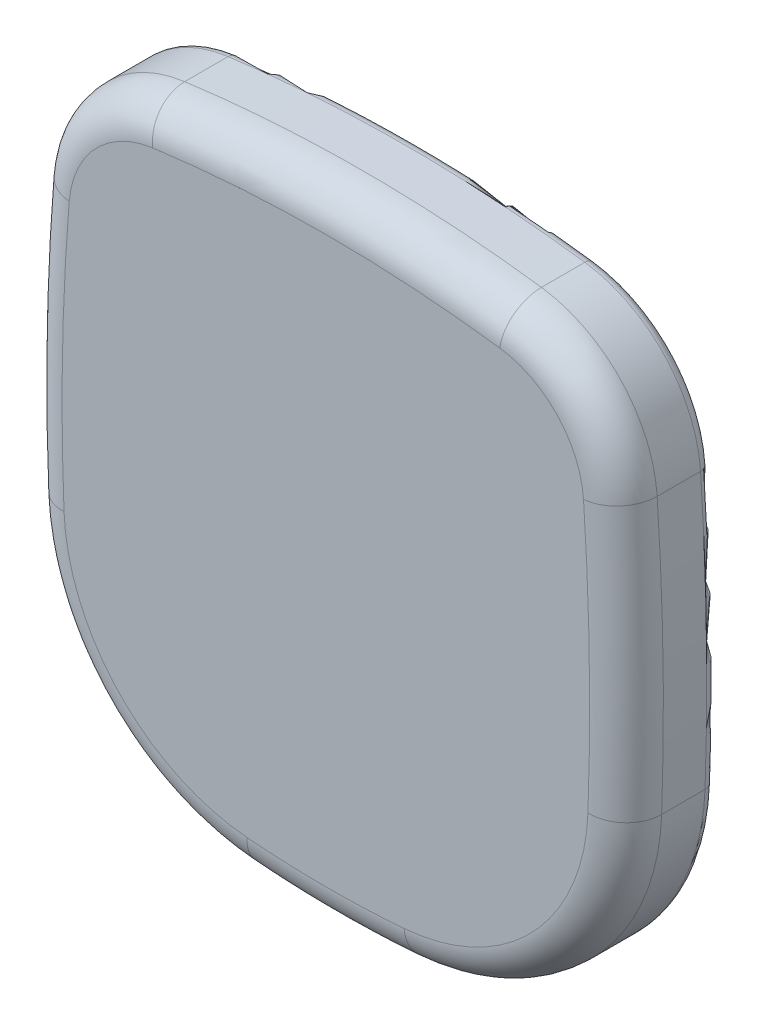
ISO-10303-21;
HEADER;
FILE_DESCRIPTION(('STEP AP214'),'2;1');
FILE_NAME('part.step','',(''),(''),'','','');
FILE_SCHEMA(('AUTOMOTIVE_DESIGN { 1 0 10303 214 1 1 1 1 }'));
ENDSEC;
DATA;
#1=APPLICATION_CONTEXT('core data for automotive mechanical design processes');
#2=APPLICATION_PROTOCOL_DEFINITION('international standard','automotive_design',2000,#1);
#3=PRODUCT_CONTEXT('',#1,'mechanical');
#4=PRODUCT('Part','Part','',(#3));
#5=PRODUCT_RELATED_PRODUCT_CATEGORY('part','',(#4));
#6=PRODUCT_DEFINITION_FORMATION('','',#4);
#7=PRODUCT_DEFINITION_CONTEXT('part definition',#1,'design');
#8=PRODUCT_DEFINITION('design','',#6,#7);
#9=PRODUCT_DEFINITION_SHAPE('','',#8);
#10=(LENGTH_UNIT() NAMED_UNIT(*) SI_UNIT(.MILLI.,.METRE.));
#11=(NAMED_UNIT(*) PLANE_ANGLE_UNIT() SI_UNIT($,.RADIAN.));
#12=(NAMED_UNIT(*) SI_UNIT($,.STERADIAN.) SOLID_ANGLE_UNIT());
#13=UNCERTAINTY_MEASURE_WITH_UNIT(LENGTH_MEASURE(1.E-05),#10,'distance_accuracy_value','');
#14=(GEOMETRIC_REPRESENTATION_CONTEXT(3) GLOBAL_UNCERTAINTY_ASSIGNED_CONTEXT((#13)) GLOBAL_UNIT_ASSIGNED_CONTEXT((#10,
#11,#12)) REPRESENTATION_CONTEXT('',''));
#15=CARTESIAN_POINT('',(0.,0.,0.));
#16=DIRECTION('',(0.,0.,1.));
#17=DIRECTION('',(1.,0.,0.));
#18=AXIS2_PLACEMENT_3D('',#15,#16,#17);
#19=CARTESIAN_POINT('',(-2.00727706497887,710.608425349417,-75.6928010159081));
#20=DIRECTION('',(0.,0.,1.));
#21=DIRECTION('',(0.,-1.,0.));
#22=AXIS2_PLACEMENT_3D('',#19,#20,#21);
#23=PLANE('',#22);
#24=CARTESIAN_POINT('',(-2.00000000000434,-122.046258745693,-75.692801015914));
#25=DIRECTION('',(0.,0.,-1.));
#26=DIRECTION('',(-0.000636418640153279,0.999999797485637,0.));
#27=AXIS2_PLACEMENT_3D('',#24,#25,#26);
#28=CIRCLE('',#27,1098.24229719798);
#29=CARTESIAN_POINT('',(-147.898706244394,966.461761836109,-75.6928010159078));
#30=VERTEX_POINT('',#29);
#31=CARTESIAN_POINT('',(142.513094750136,966.646585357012,-75.6928010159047));
#32=VERTEX_POINT('',#31);
#33=EDGE_CURVE('E37',#30,#32,#28,.T.);
#34=ORIENTED_EDGE('',*,*,#33,.F.);
#35=CARTESIAN_POINT('',(-137.14729439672,886.248589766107,-75.6928010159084));
#36=DIRECTION('',(0.,0.,-1.));
#37=DIRECTION('',(-0.725293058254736,0.688440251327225,0.));
#38=AXIS2_PLACEMENT_3D('',#35,#36,#37);
#39=CIRCLE('',#38,80.9305);
#40=CARTESIAN_POINT('',(-217.811675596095,892.806290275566,-75.6928010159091));
#41=VERTEX_POINT('',#40);
#42=EDGE_CURVE('E265',#41,#30,#39,.T.);
#43=ORIENTED_EDGE('',*,*,#42,.F.);
#44=CARTESIAN_POINT('',(1609.03192702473,744.291009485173,-75.6928010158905));
#45=DIRECTION('',(0.,0.,-1.));
#46=DIRECTION('',(-0.99981732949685,0.0191130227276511,0.));
#47=AXIS2_PLACEMENT_3D('',#44,#45,#46);
#48=CIRCLE('',#47,1832.87051835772);
#49=CARTESIAN_POINT('',(-222.153070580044,665.704486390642,-75.6928010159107));
#50=VERTEX_POINT('',#49);
#51=EDGE_CURVE('E257',#50,#41,#48,.T.);
#52=ORIENTED_EDGE('',*,*,#51,.F.);
#53=CARTESIAN_POINT('',(-55.0024249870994,672.877867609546,-75.6928010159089));
#54=DIRECTION('',(0.,0.,-1.));
#55=DIRECTION('',(-0.721021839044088,-0.69291233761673,0.));
#56=AXIS2_PLACEMENT_3D('',#53,#54,#55);
#57=CIRCLE('',#56,167.3045);
#58=CARTESIAN_POINT('',(-68.8135380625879,506.144401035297,-75.6928010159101));
#59=VERTEX_POINT('',#58);
#60=EDGE_CURVE('E287',#59,#50,#57,.T.);
#61=ORIENTED_EDGE('',*,*,#60,.F.);
#62=CARTESIAN_POINT('',(-2.00000000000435,1312.74505330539,-75.6928010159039));
#63=DIRECTION('',(0.,0.,-1.));
#64=DIRECTION('',(-0.00147322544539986,-0.999998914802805,0.));
#65=AXIS2_PLACEMENT_3D('',#62,#63,#64);
#66=CIRCLE('',#65,809.363120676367);
#67=CARTESIAN_POINT('',(-30.5000000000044,503.8838716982,-75.6928010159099));
#68=VERTEX_POINT('',#67);
#69=EDGE_CURVE('E302',#68,#59,#66,.T.);
#70=ORIENTED_EDGE('',*,*,#69,.F.);
#71=CARTESIAN_POINT('',(-2.00000000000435,1312.74505330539,-75.6928010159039));
#72=DIRECTION('',(0.,0.,-1.));
#73=DIRECTION('',(-0.00147322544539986,-0.999998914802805,0.));
#74=AXIS2_PLACEMENT_3D('',#71,#72,#73);
#75=CIRCLE('',#74,809.363120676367);
#76=CARTESIAN_POINT('',(26.4999999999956,503.8838716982,-75.6928010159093));
#77=VERTEX_POINT('',#76);
#78=EDGE_CURVE('E316',#77,#68,#75,.T.);
#79=ORIENTED_EDGE('',*,*,#78,.F.);
#80=CARTESIAN_POINT('',(-2.00000000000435,1312.74505330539,-75.6928010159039));
#81=DIRECTION('',(0.,0.,-1.));
#82=DIRECTION('',(-0.00147322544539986,-0.999998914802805,0.));
#83=AXIS2_PLACEMENT_3D('',#80,#81,#82);
#84=CIRCLE('',#83,809.363120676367);
#85=CARTESIAN_POINT('',(62.4366414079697,505.951039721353,-75.6928010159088));
#86=VERTEX_POINT('',#85);
#87=EDGE_CURVE('E299',#86,#77,#84,.T.);
#88=ORIENTED_EDGE('',*,*,#87,.F.);
#89=CARTESIAN_POINT('',(49.1168597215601,672.724476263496,-75.6928010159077));
#90=DIRECTION('',(0.,0.,-1.));
#91=DIRECTION('',(0.722234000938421,-0.691648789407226,0.));
#92=AXIS2_PLACEMENT_3D('',#89,#90,#91);
#93=CIRCLE('',#92,167.3045);
#94=CARTESIAN_POINT('',(216.310286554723,666.629089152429,-75.692801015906));
#95=VERTEX_POINT('',#94);
#96=EDGE_CURVE('E168',#95,#86,#93,.T.);
#97=ORIENTED_EDGE('',*,*,#96,.F.);
#98=CARTESIAN_POINT('',(-1913.9174345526,744.291009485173,-75.6928010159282));
#99=DIRECTION('',(0.,0.,-1.));
#100=DIRECTION('',(0.999864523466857,0.016460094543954,0.));
#101=AXIS2_PLACEMENT_3D('',#98,#99,#100);
#102=CIRCLE('',#101,2131.64291513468);
#103=CARTESIAN_POINT('',(212.599682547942,892.028845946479,-75.6928010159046));
#104=VERTEX_POINT('',#103);
#105=EDGE_CURVE('E164',#104,#95,#102,.T.);
#106=ORIENTED_EDGE('',*,*,#105,.F.);
#107=CARTESIAN_POINT('',(131.863789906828,886.419793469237,-75.6928010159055));
#108=DIRECTION('',(0.,0.,-1.));
#109=DIRECTION('',(0.728891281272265,0.684629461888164,0.));
#110=AXIS2_PLACEMENT_3D('',#107,#108,#109);
#111=CIRCLE('',#110,80.9305);
#112=EDGE_CURVE('E28',#32,#104,#111,.T.);
#113=ORIENTED_EDGE('',*,*,#112,.F.);
#114=EDGE_LOOP('',(#34,#43,#52,#61,#70,#79,#88,#97,#106,#113));
#115=FACE_BOUND('',#114,.T.);
#116=ADVANCED_FACE('F17',(#115),#23,.T.);
#117=CARTESIAN_POINT('',(131.863789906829,886.419793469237,-106.548801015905));
#118=DIRECTION('',(0.,0.,-1.));
#119=DIRECTION('',(0.,1.,0.));
#120=AXIS2_PLACEMENT_3D('',#117,#118,#119);
#121=TOROIDAL_SURFACE('',#120,80.9305,30.856);
#122=CARTESIAN_POINT('',(212.599682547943,892.02884594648,-106.548801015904));
#123=DIRECTION('',(0.0693070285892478,-0.997595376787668,0.));
#124=DIRECTION('',(0.997595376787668,0.0693070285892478,0.));
#125=AXIS2_PLACEMENT_3D('',#122,#123,#124);
#126=CIRCLE('',#125,30.8560000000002);
#127=CARTESIAN_POINT('',(243.381485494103,894.167383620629,-106.548801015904));
#128=VERTEX_POINT('',#127);
#129=EDGE_CURVE('E174',#128,#104,#126,.T.);
#130=ORIENTED_EDGE('',*,*,#129,.F.);
#131=CARTESIAN_POINT('',(131.863789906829,886.419793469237,-106.548801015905));
#132=DIRECTION('',(0.,0.,1.));
#133=DIRECTION('',(0.728891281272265,0.684629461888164,0.));
#134=AXIS2_PLACEMENT_3D('',#131,#132,#133);
#135=CIRCLE('',#134,111.7865);
#136=CARTESIAN_POINT('',(146.573306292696,997.234285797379,-106.548801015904));
#137=VERTEX_POINT('',#136);
#138=EDGE_CURVE('E11',#128,#137,#135,.T.);
#139=ORIENTED_EDGE('',*,*,#138,.T.);
#140=CARTESIAN_POINT('',(142.513094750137,966.646585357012,-106.548801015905));
#141=DIRECTION('',(-0.991304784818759,0.13158580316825,0.));
#142=DIRECTION('',(0.,0.,1.));
#143=AXIS2_PLACEMENT_3D('',#140,#141,#142);
#144=CIRCLE('',#143,30.856);
#145=EDGE_CURVE('E181',#32,#137,#144,.T.);
#146=ORIENTED_EDGE('',*,*,#145,.F.);
#147=ORIENTED_EDGE('',*,*,#112,.T.);
#148=EDGE_LOOP('',(#130,#139,#146,#147));
#149=FACE_BOUND('',#148,.T.);
#150=ADVANCED_FACE('F19',(#149),#121,.T.);
#151=CARTESIAN_POINT('',(-1913.9174345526,744.291009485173,-106.548801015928));
#152=DIRECTION('',(0.,0.,-1.));
#153=DIRECTION('',(0.,1.,0.));
#154=AXIS2_PLACEMENT_3D('',#151,#152,#153);
#155=TOROIDAL_SURFACE('',#154,2131.64291513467,30.856);
#156=ORIENTED_EDGE('',*,*,#129,.T.);
#157=ORIENTED_EDGE('',*,*,#105,.T.);
#158=CARTESIAN_POINT('',(216.310286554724,666.629089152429,-106.548801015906));
#159=DIRECTION('',(-0.0364328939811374,-0.999336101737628,0.));
#160=DIRECTION('',(0.999336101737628,-0.0364328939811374,0.));
#161=AXIS2_PLACEMENT_3D('',#158,#159,#160);
#162=CIRCLE('',#161,30.8560000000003);
#163=CARTESIAN_POINT('',(247.14580130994,665.504915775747,-106.548801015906));
#164=VERTEX_POINT('',#163);
#165=EDGE_CURVE('E401',#164,#95,#162,.T.);
#166=ORIENTED_EDGE('',*,*,#165,.F.);
#167=CARTESIAN_POINT('',(-1913.9174345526,744.291009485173,-106.548801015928));
#168=DIRECTION('',(0.,0.,1.));
#169=DIRECTION('',(0.999864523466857,0.016460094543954,0.));
#170=AXIS2_PLACEMENT_3D('',#167,#168,#169);
#171=CIRCLE('',#170,2162.49891513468);
#172=EDGE_CURVE('E175',#164,#128,#171,.T.);
#173=ORIENTED_EDGE('',*,*,#172,.T.);
#174=EDGE_LOOP('',(#156,#157,#166,#173));
#175=FACE_BOUND('',#174,.T.);
#176=ADVANCED_FACE('F184',(#175),#155,.T.);
#177=CARTESIAN_POINT('',(49.1168597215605,672.724476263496,-106.548801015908));
#178=DIRECTION('',(0.,0.,-1.));
#179=DIRECTION('',(0.,1.,0.));
#180=AXIS2_PLACEMENT_3D('',#177,#178,#179);
#181=TOROIDAL_SURFACE('',#180,167.3045,30.856);
#182=ORIENTED_EDGE('',*,*,#165,.T.);
#183=ORIENTED_EDGE('',*,*,#96,.T.);
#184=CARTESIAN_POINT('',(62.4366414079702,505.951039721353,-106.548801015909));
#185=DIRECTION('',(-0.99682576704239,-0.079614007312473,0.));
#186=DIRECTION('',(0.079614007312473,-0.99682576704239,0.));
#187=AXIS2_PLACEMENT_3D('',#184,#185,#186);
#188=CIRCLE('',#187,30.8560000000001);
#189=CARTESIAN_POINT('',(64.8932112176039,475.192983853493,-106.548801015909));
#190=VERTEX_POINT('',#189);
#191=EDGE_CURVE('E295',#190,#86,#188,.T.);
#192=ORIENTED_EDGE('',*,*,#191,.F.);
#193=CARTESIAN_POINT('',(49.1168597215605,672.724476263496,-106.548801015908));
#194=DIRECTION('',(0.,0.,1.));
#195=DIRECTION('',(0.722234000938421,-0.691648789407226,0.));
#196=AXIS2_PLACEMENT_3D('',#193,#194,#195);
#197=CIRCLE('',#196,198.1605);
#198=EDGE_CURVE('E193',#190,#164,#197,.T.);
#199=ORIENTED_EDGE('',*,*,#198,.T.);
#200=EDGE_LOOP('',(#182,#183,#192,#199));
#201=FACE_BOUND('',#200,.T.);
#202=ADVANCED_FACE('F504',(#201),#181,.T.);
#203=CARTESIAN_POINT('',(-2.00000000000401,1312.74505330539,-106.548801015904));
#204=DIRECTION('',(0.,0.,-1.));
#205=DIRECTION('',(0.,1.,0.));
#206=AXIS2_PLACEMENT_3D('',#203,#204,#205);
#207=TOROIDAL_SURFACE('',#206,809.363120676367,30.856);
#208=CARTESIAN_POINT('',(-2.00000000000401,1312.74505330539,-106.548801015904));
#209=DIRECTION('',(0.,0.,1.));
#210=DIRECTION('',(-0.00147322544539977,-0.999998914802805,0.));
#211=AXIS2_PLACEMENT_3D('',#208,#209,#210);
#212=CIRCLE('',#211,840.219120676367);
#213=CARTESIAN_POINT('',(26.499999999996,473.009427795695,-106.548801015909));
#214=VERTEX_POINT('',#213);
#215=EDGE_CURVE('E195',#214,#190,#212,.T.);
#216=ORIENTED_EDGE('',*,*,#215,.T.);
#217=ORIENTED_EDGE('',*,*,#191,.T.);
#218=ORIENTED_EDGE('',*,*,#87,.T.);
#219=ORIENTED_EDGE('',*,*,#78,.T.);
#220=ORIENTED_EDGE('',*,*,#69,.T.);
#221=CARTESIAN_POINT('',(-68.8135380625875,506.144401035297,-106.54880101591));
#222=DIRECTION('',(-0.99658686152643,0.0825507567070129,0.));
#223=DIRECTION('',(-0.0825507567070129,-0.99658686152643,0.));
#224=AXIS2_PLACEMENT_3D('',#221,#222,#223);
#225=CIRCLE('',#224,30.8560000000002);
#226=CARTESIAN_POINT('',(-71.3607242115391,475.393716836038,-106.54880101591));
#227=VERTEX_POINT('',#226);
#228=EDGE_CURVE('E201',#227,#59,#225,.T.);
#229=ORIENTED_EDGE('',*,*,#228,.F.);
#230=CARTESIAN_POINT('',(-2.00000000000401,1312.74505330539,-106.548801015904));
#231=DIRECTION('',(0.,0.,1.));
#232=DIRECTION('',(-0.00147322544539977,-0.999998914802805,0.));
#233=AXIS2_PLACEMENT_3D('',#230,#231,#232);
#234=CIRCLE('',#233,840.219120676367);
#235=CARTESIAN_POINT('',(-30.5000000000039,473.009427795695,-106.54880101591));
#236=VERTEX_POINT('',#235);
#237=EDGE_CURVE('E200',#227,#236,#234,.T.);
#238=ORIENTED_EDGE('',*,*,#237,.T.);
#239=CARTESIAN_POINT('',(-2.00000000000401,1312.74505330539,-106.548801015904));
#240=DIRECTION('',(0.,0.,1.));
#241=DIRECTION('',(-0.00147322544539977,-0.999998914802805,0.));
#242=AXIS2_PLACEMENT_3D('',#239,#240,#241);
#243=CIRCLE('',#242,840.219120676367);
#244=EDGE_CURVE('E196',#236,#214,#243,.T.);
#245=ORIENTED_EDGE('',*,*,#244,.T.);
#246=EDGE_LOOP('',(#216,#217,#218,#219,#220,#229,#238,#245));
#247=FACE_BOUND('',#246,.T.);
#248=ADVANCED_FACE('F472',(#247),#207,.T.);
#249=CARTESIAN_POINT('',(-55.002424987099,672.877867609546,-106.548801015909));
#250=DIRECTION('',(0.,0.,-1.));
#251=DIRECTION('',(0.,1.,0.));
#252=AXIS2_PLACEMENT_3D('',#249,#250,#251);
#253=TOROIDAL_SURFACE('',#252,167.3045,30.856);
#254=ORIENTED_EDGE('',*,*,#228,.T.);
#255=ORIENTED_EDGE('',*,*,#60,.T.);
#256=CARTESIAN_POINT('',(-222.153070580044,665.704486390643,-106.548801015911));
#257=DIRECTION('',(-0.0428762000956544,0.999080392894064,0.));
#258=DIRECTION('',(-0.999080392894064,-0.0428762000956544,0.));
#259=AXIS2_PLACEMENT_3D('',#256,#257,#258);
#260=CIRCLE('',#259,30.8560000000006);
#261=CARTESIAN_POINT('',(-252.980695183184,664.381498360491,-106.548801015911));
#262=VERTEX_POINT('',#261);
#263=EDGE_CURVE('E408',#262,#50,#260,.T.);
#264=ORIENTED_EDGE('',*,*,#263,.F.);
#265=CARTESIAN_POINT('',(-55.002424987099,672.877867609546,-106.548801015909));
#266=DIRECTION('',(0.,0.,1.));
#267=DIRECTION('',(-0.721021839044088,-0.69291233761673,0.));
#268=AXIS2_PLACEMENT_3D('',#265,#266,#267);
#269=CIRCLE('',#268,198.1605);
#270=EDGE_CURVE('E411',#262,#227,#269,.T.);
#271=ORIENTED_EDGE('',*,*,#270,.T.);
#272=EDGE_LOOP('',(#254,#255,#264,#271));
#273=FACE_BOUND('',#272,.T.);
#274=ADVANCED_FACE('F476',(#273),#253,.T.);
#275=CARTESIAN_POINT('',(1609.03192702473,744.291009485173,-106.548801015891));
#276=DIRECTION('',(0.,0.,-1.));
#277=DIRECTION('',(0.,1.,0.));
#278=AXIS2_PLACEMENT_3D('',#275,#276,#277);
#279=TOROIDAL_SURFACE('',#278,1832.87051835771,30.856);
#280=ORIENTED_EDGE('',*,*,#263,.T.);
#281=ORIENTED_EDGE('',*,*,#51,.T.);
#282=CARTESIAN_POINT('',(-217.811675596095,892.806290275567,-106.548801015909));
#283=DIRECTION('',(0.0810287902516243,0.996711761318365,0.));
#284=DIRECTION('',(-0.996711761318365,0.0810287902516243,0.));
#285=AXIS2_PLACEMENT_3D('',#282,#283,#284);
#286=CIRCLE('',#285,30.8559999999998);
#287=CARTESIAN_POINT('',(-248.566213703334,895.306514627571,-106.548801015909));
#288=VERTEX_POINT('',#287);
#289=EDGE_CURVE('E258',#288,#41,#286,.T.);
#290=ORIENTED_EDGE('',*,*,#289,.F.);
#291=CARTESIAN_POINT('',(1609.03192702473,744.291009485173,-106.548801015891));
#292=DIRECTION('',(0.,0.,1.));
#293=DIRECTION('',(-0.99981732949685,0.0191130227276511,0.));
#294=AXIS2_PLACEMENT_3D('',#291,#292,#293);
#295=CIRCLE('',#294,1863.72651835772);
#296=EDGE_CURVE('E254',#288,#262,#295,.T.);
#297=ORIENTED_EDGE('',*,*,#296,.T.);
#298=EDGE_LOOP('',(#280,#281,#290,#297));
#299=FACE_BOUND('',#298,.T.);
#300=ADVANCED_FACE('F478',(#299),#279,.T.);
#301=CARTESIAN_POINT('',(-137.147294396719,886.248589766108,-106.548801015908));
#302=DIRECTION('',(0.,0.,-1.));
#303=DIRECTION('',(0.,1.,0.));
#304=AXIS2_PLACEMENT_3D('',#301,#302,#303);
#305=TOROIDAL_SURFACE('',#304,80.9305,30.856);
#306=ORIENTED_EDGE('',*,*,#289,.T.);
#307=ORIENTED_EDGE('',*,*,#42,.T.);
#308=CARTESIAN_POINT('',(-147.898706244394,966.461761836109,-106.548801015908));
#309=DIRECTION('',(0.991136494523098,0.132847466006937,0.));
#310=DIRECTION('',(-0.132847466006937,0.991136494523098,0.));
#311=AXIS2_PLACEMENT_3D('',#308,#309,#310);
#312=CIRCLE('',#311,30.8560000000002);
#313=CARTESIAN_POINT('',(-151.997847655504,997.044269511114,-106.548801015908));
#314=VERTEX_POINT('',#313);
#315=EDGE_CURVE('E204',#314,#30,#312,.T.);
#316=ORIENTED_EDGE('',*,*,#315,.F.);
#317=CARTESIAN_POINT('',(-137.147294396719,886.248589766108,-106.548801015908));
#318=DIRECTION('',(0.,0.,1.));
#319=DIRECTION('',(-0.725293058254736,0.688440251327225,0.));
#320=AXIS2_PLACEMENT_3D('',#317,#318,#319);
#321=CIRCLE('',#320,111.7865);
#322=EDGE_CURVE('E326',#314,#288,#321,.T.);
#323=ORIENTED_EDGE('',*,*,#322,.T.);
#324=EDGE_LOOP('',(#306,#307,#316,#323));
#325=FACE_BOUND('',#324,.T.);
#326=ADVANCED_FACE('F532',(#325),#305,.T.);
#327=CARTESIAN_POINT('',(-2.00000000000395,-122.046258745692,-106.548801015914));
#328=DIRECTION('',(0.,0.,-1.));
#329=DIRECTION('',(0.,1.,0.));
#330=AXIS2_PLACEMENT_3D('',#327,#328,#329);
#331=TOROIDAL_SURFACE('',#330,1098.24229719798,30.856);
#332=ORIENTED_EDGE('',*,*,#315,.T.);
#333=ORIENTED_EDGE('',*,*,#33,.T.);
#334=ORIENTED_EDGE('',*,*,#145,.T.);
#335=CARTESIAN_POINT('',(-2.00000000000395,-122.046258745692,-106.548801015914));
#336=DIRECTION('',(0.,0.,1.));
#337=DIRECTION('',(-0.000636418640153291,0.999999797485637,0.));
#338=AXIS2_PLACEMENT_3D('',#335,#336,#337);
#339=CIRCLE('',#338,1129.09829719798);
#340=EDGE_CURVE('E261',#137,#314,#339,.T.);
#341=ORIENTED_EDGE('',*,*,#340,.T.);
#342=EDGE_LOOP('',(#332,#333,#334,#341));
#343=FACE_BOUND('',#342,.T.);
#344=ADVANCED_FACE('F530',(#343),#331,.T.);
#345=CARTESIAN_POINT('',(-2.00000000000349,639.791009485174,-151.692801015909));
#346=DIRECTION('',(0.,0.,1.));
#347=DIRECTION('',(0.,-1.,0.));
#348=AXIS2_PLACEMENT_3D('',#345,#346,#347);
#349=PLANE('',#348);
#350=CARTESIAN_POINT('',(-2.00000000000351,1312.74505330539,-151.692801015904));
#351=DIRECTION('',(0.,0.,1.));
#352=DIRECTION('',(0.,-1.,0.));
#353=AXIS2_PLACEMENT_3D('',#350,#351,#352);
#354=CIRCLE('',#353,831.393620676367);
#355=CARTESIAN_POINT('',(-40.0000000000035,482.220308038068,-151.69280101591));
#356=VERTEX_POINT('',#355);
#357=CARTESIAN_POINT('',(39.9999999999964,482.412979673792,-151.692801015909));
#358=VERTEX_POINT('',#357);
#359=EDGE_CURVE('E283',#356,#358,#354,.T.);
#360=ORIENTED_EDGE('',*,*,#359,.F.);
#361=CARTESIAN_POINT('',(-2.00000000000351,1312.74505330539,-151.692801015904));
#362=DIRECTION('',(0.,0.,1.));
#363=DIRECTION('',(-0.00147322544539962,-0.999998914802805,0.));
#364=AXIS2_PLACEMENT_3D('',#361,#362,#363);
#365=CIRCLE('',#364,831.393620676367);
#366=CARTESIAN_POINT('',(-70.6321725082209,484.18909418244,-151.69280101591));
#367=VERTEX_POINT('',#366);
#368=EDGE_CURVE('E322',#367,#356,#365,.T.);
#369=ORIENTED_EDGE('',*,*,#368,.F.);
#370=CARTESIAN_POINT('',(-55.0024249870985,672.877867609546,-151.692801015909));
#371=DIRECTION('',(0.,0.,1.));
#372=DIRECTION('',(-0.721021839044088,-0.69291233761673,0.));
#373=AXIS2_PLACEMENT_3D('',#370,#371,#372);
#374=CIRCLE('',#373,189.335);
#375=CARTESIAN_POINT('',(-244.163311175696,664.759902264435,-151.692801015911));
#376=VERTEX_POINT('',#375);
#377=EDGE_CURVE('E290',#376,#367,#374,.T.);
#378=ORIENTED_EDGE('',*,*,#377,.F.);
#379=CARTESIAN_POINT('',(1609.03192702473,744.291009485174,-151.692801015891));
#380=DIRECTION('',(0.,0.,1.));
#381=DIRECTION('',(-0.99981732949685,0.019113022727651,0.));
#382=AXIS2_PLACEMENT_3D('',#379,#380,#381);
#383=CIRCLE('',#382,1854.90101835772);
#384=CARTESIAN_POINT('',(-245.447805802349,704.759902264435,-151.692801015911));
#385=VERTEX_POINT('',#384);
#386=EDGE_CURVE('E248',#385,#376,#383,.T.);
#387=ORIENTED_EDGE('',*,*,#386,.F.);
#388=CARTESIAN_POINT('',(1609.03192702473,744.291009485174,-151.692801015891));
#389=DIRECTION('',(0.,0.,1.));
#390=DIRECTION('',(-0.99981732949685,0.019113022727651,0.));
#391=AXIS2_PLACEMENT_3D('',#388,#389,#390);
#392=CIRCLE('',#391,1854.90101835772);
#393=CARTESIAN_POINT('',(-245.756150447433,764.759902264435,-151.69280101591));
#394=VERTEX_POINT('',#393);
#395=EDGE_CURVE('E209',#394,#385,#392,.T.);
#396=ORIENTED_EDGE('',*,*,#395,.F.);
#397=CARTESIAN_POINT('',(1609.03192702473,744.291009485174,-151.692801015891));
#398=DIRECTION('',(0.,0.,1.));
#399=DIRECTION('',(-0.99981732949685,0.019113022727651,0.));
#400=AXIS2_PLACEMENT_3D('',#397,#398,#399);
#401=CIRCLE('',#400,1854.90101835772);
#402=CARTESIAN_POINT('',(-239.769734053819,894.591395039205,-151.692801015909));
#403=VERTEX_POINT('',#402);
#404=EDGE_CURVE('E205',#403,#394,#401,.T.);
#405=ORIENTED_EDGE('',*,*,#404,.F.);
#406=CARTESIAN_POINT('',(-137.147294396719,886.248589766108,-151.692801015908));
#407=DIRECTION('',(0.,0.,1.));
#408=DIRECTION('',(-0.725293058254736,0.688440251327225,0.));
#409=AXIS2_PLACEMENT_3D('',#406,#407,#408);
#410=CIRCLE('',#409,102.961);
#411=CARTESIAN_POINT('',(-150.825402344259,988.296994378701,-151.692801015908));
#412=VERTEX_POINT('',#411);
#413=EDGE_CURVE('E312',#412,#403,#410,.T.);
#414=ORIENTED_EDGE('',*,*,#413,.F.);
#415=CARTESIAN_POINT('',(-2.00000000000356,-122.046258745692,-151.692801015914));
#416=DIRECTION('',(0.,0.,1.));
#417=DIRECTION('',(-0.000636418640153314,0.999999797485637,0.));
#418=AXIS2_PLACEMENT_3D('',#415,#416,#417);
#419=CIRCLE('',#418,1120.27279719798);
#420=CARTESIAN_POINT('',(145.411995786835,988.485525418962,-151.692801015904));
#421=VERTEX_POINT('',#420);
#422=EDGE_CURVE('E343',#421,#412,#419,.T.);
#423=ORIENTED_EDGE('',*,*,#422,.F.);
#424=CARTESIAN_POINT('',(131.863789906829,886.419793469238,-151.692801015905));
#425=DIRECTION('',(0.,0.,1.));
#426=DIRECTION('',(0.728891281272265,0.684629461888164,0.));
#427=AXIS2_PLACEMENT_3D('',#424,#425,#426);
#428=CIRCLE('',#427,102.961);
#429=CARTESIAN_POINT('',(234.577207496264,893.555714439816,-151.692801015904));
#430=VERTEX_POINT('',#429);
#431=EDGE_CURVE('E241',#430,#421,#428,.T.);
#432=ORIENTED_EDGE('',*,*,#431,.F.);
#433=CARTESIAN_POINT('',(-1913.9174345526,744.291009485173,-151.692801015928));
#434=DIRECTION('',(0.,0.,1.));
#435=DIRECTION('',(0.999864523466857,0.016460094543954,0.));
#436=AXIS2_PLACEMENT_3D('',#433,#434,#435);
#437=CIRCLE('',#436,2153.67341513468);
#438=CARTESIAN_POINT('',(239.658708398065,764.759902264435,-151.692801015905));
#439=VERTEX_POINT('',#438);
#440=EDGE_CURVE('E249',#439,#430,#437,.T.);
#441=ORIENTED_EDGE('',*,*,#440,.F.);
#442=CARTESIAN_POINT('',(-1913.9174345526,744.291009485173,-151.692801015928));
#443=DIRECTION('',(0.,0.,1.));
#444=DIRECTION('',(0.999864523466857,0.016460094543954,0.));
#445=AXIS2_PLACEMENT_3D('',#442,#443,#444);
#446=CIRCLE('',#445,2153.67341513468);
#447=CARTESIAN_POINT('',(239.393149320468,704.759902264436,-151.692801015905));
#448=VERTEX_POINT('',#447);
#449=EDGE_CURVE('E252',#448,#439,#446,.T.);
#450=ORIENTED_EDGE('',*,*,#449,.F.);
#451=CARTESIAN_POINT('',(-1913.9174345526,744.291009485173,-151.692801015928));
#452=DIRECTION('',(0.,0.,1.));
#453=DIRECTION('',(0.999864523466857,0.016460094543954,0.));
#454=AXIS2_PLACEMENT_3D('',#451,#452,#453);
#455=CIRCLE('',#454,2153.67341513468);
#456=CARTESIAN_POINT('',(238.326160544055,665.826454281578,-151.692801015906));
#457=VERTEX_POINT('',#456);
#458=EDGE_CURVE('E279',#457,#448,#455,.T.);
#459=ORIENTED_EDGE('',*,*,#458,.F.);
#460=CARTESIAN_POINT('',(49.116859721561,672.724476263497,-151.692801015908));
#461=DIRECTION('',(0.,0.,1.));
#462=DIRECTION('',(0.72223400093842,-0.691648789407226,0.));
#463=AXIS2_PLACEMENT_3D('',#460,#461,#462);
#464=CIRCLE('',#463,189.335);
#465=CARTESIAN_POINT('',(64.190577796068,483.990469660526,-151.692801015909));
#466=VERTEX_POINT('',#465);
#467=EDGE_CURVE('E356',#466,#457,#464,.T.);
#468=ORIENTED_EDGE('',*,*,#467,.F.);
#469=CARTESIAN_POINT('',(-2.00000000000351,1312.74505330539,-151.692801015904));
#470=DIRECTION('',(0.,0.,1.));
#471=DIRECTION('',(-0.00147322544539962,-0.999998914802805,0.));
#472=AXIS2_PLACEMENT_3D('',#469,#470,#471);
#473=CIRCLE('',#472,831.393620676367);
#474=EDGE_CURVE('E280',#358,#466,#473,.T.);
#475=ORIENTED_EDGE('',*,*,#474,.F.);
#476=EDGE_LOOP('',(#360,#369,#378,#387,#396,#405,#414,#423,#432,#441,#450,#459,#468,#475));
#477=FACE_BOUND('',#476,.T.);
#478=ADVANCED_FACE('F435',(#477),#349,.F.);
#479=CARTESIAN_POINT('',(-2.00000000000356,-122.046258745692,-142.867301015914));
#480=DIRECTION('',(0.,0.,1.));
#481=DIRECTION('',(0.,-1.,0.));
#482=AXIS2_PLACEMENT_3D('',#479,#480,#481);
#483=TOROIDAL_SURFACE('',#482,1120.27279719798,8.8255);
#484=CARTESIAN_POINT('',(145.411995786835,988.485525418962,-142.867301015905));
#485=DIRECTION('',(-0.991304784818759,0.13158580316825,0.));
#486=DIRECTION('',(0.13158580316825,0.991304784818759,0.));
#487=AXIS2_PLACEMENT_3D('',#484,#485,#486);
#488=CIRCLE('',#487,8.82550000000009);
#489=CARTESIAN_POINT('',(146.573306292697,997.23428579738,-142.867301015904));
#490=VERTEX_POINT('',#489);
#491=EDGE_CURVE('E346',#490,#421,#488,.T.);
#492=ORIENTED_EDGE('',*,*,#491,.T.);
#493=ORIENTED_EDGE('',*,*,#422,.T.);
#494=CARTESIAN_POINT('',(-150.825402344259,988.2969943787,-142.867301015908));
#495=DIRECTION('',(0.991136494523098,0.132847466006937,0.));
#496=DIRECTION('',(0.,0.,-1.));
#497=AXIS2_PLACEMENT_3D('',#494,#495,#496);
#498=CIRCLE('',#497,8.82550000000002);
#499=CARTESIAN_POINT('',(-151.997847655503,997.044269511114,-142.867301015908));
#500=VERTEX_POINT('',#499);
#501=EDGE_CURVE('E347',#412,#500,#498,.T.);
#502=ORIENTED_EDGE('',*,*,#501,.T.);
#503=CARTESIAN_POINT('',(-2.00000000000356,-122.046258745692,-142.867301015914));
#504=DIRECTION('',(0.,0.,-1.));
#505=DIRECTION('',(-0.000636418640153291,0.999999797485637,0.));
#506=AXIS2_PLACEMENT_3D('',#503,#504,#505);
#507=CIRCLE('',#506,1129.09829719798);
#508=EDGE_CURVE('E351',#500,#490,#507,.T.);
#509=ORIENTED_EDGE('',*,*,#508,.T.);
#510=EDGE_LOOP('',(#492,#493,#502,#509));
#511=FACE_BOUND('',#510,.T.);
#512=ADVANCED_FACE('F439',(#511),#483,.T.);
#513=CARTESIAN_POINT('',(-137.147294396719,886.248589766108,-142.867301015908));
#514=DIRECTION('',(0.,0.,-1.));
#515=DIRECTION('',(0.,1.,0.));
#516=AXIS2_PLACEMENT_3D('',#513,#514,#515);
#517=TOROIDAL_SURFACE('',#516,102.961,8.8255);
#518=CARTESIAN_POINT('',(-239.769734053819,894.591395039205,-142.867301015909));
#519=DIRECTION('',(0.0810287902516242,0.996711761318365,0.));
#520=DIRECTION('',(0.,0.,-1.));
#521=AXIS2_PLACEMENT_3D('',#518,#519,#520);
#522=CIRCLE('',#521,8.82550000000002);
#523=CARTESIAN_POINT('',(-248.566213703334,895.306514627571,-142.867301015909));
#524=VERTEX_POINT('',#523);
#525=EDGE_CURVE('E311',#403,#524,#522,.T.);
#526=ORIENTED_EDGE('',*,*,#525,.T.);
#527=CARTESIAN_POINT('',(-137.147294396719,886.248589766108,-142.867301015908));
#528=DIRECTION('',(0.,0.,-1.));
#529=DIRECTION('',(-0.725293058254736,0.688440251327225,0.));
#530=AXIS2_PLACEMENT_3D('',#527,#528,#529);
#531=CIRCLE('',#530,111.7865);
#532=EDGE_CURVE('E307',#524,#500,#531,.T.);
#533=ORIENTED_EDGE('',*,*,#532,.T.);
#534=ORIENTED_EDGE('',*,*,#501,.F.);
#535=ORIENTED_EDGE('',*,*,#413,.T.);
#536=EDGE_LOOP('',(#526,#533,#534,#535));
#537=FACE_BOUND('',#536,.T.);
#538=ADVANCED_FACE('F493',(#537),#517,.T.);
#539=CARTESIAN_POINT('',(131.863789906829,886.419793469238,-142.867301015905));
#540=DIRECTION('',(0.,0.,1.));
#541=DIRECTION('',(0.,-1.,0.));
#542=AXIS2_PLACEMENT_3D('',#539,#540,#541);
#543=TOROIDAL_SURFACE('',#542,102.961,8.8255);
#544=CARTESIAN_POINT('',(234.577207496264,893.555714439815,-142.867301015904));
#545=DIRECTION('',(-0.0693070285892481,0.997595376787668,0.));
#546=DIRECTION('',(0.997595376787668,0.0693070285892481,0.));
#547=AXIS2_PLACEMENT_3D('',#544,#545,#546);
#548=CIRCLE('',#547,8.82549999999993);
#549=CARTESIAN_POINT('',(243.381485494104,894.16738362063,-142.867301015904));
#550=VERTEX_POINT('',#549);
#551=EDGE_CURVE('E243',#550,#430,#548,.T.);
#552=ORIENTED_EDGE('',*,*,#551,.T.);
#553=ORIENTED_EDGE('',*,*,#431,.T.);
#554=ORIENTED_EDGE('',*,*,#491,.F.);
#555=CARTESIAN_POINT('',(131.863789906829,886.419793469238,-142.867301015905));
#556=DIRECTION('',(0.,0.,-1.));
#557=DIRECTION('',(0.728891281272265,0.684629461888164,0.));
#558=AXIS2_PLACEMENT_3D('',#555,#556,#557);
#559=CIRCLE('',#558,111.7865);
#560=EDGE_CURVE('E244',#490,#550,#559,.T.);
#561=ORIENTED_EDGE('',*,*,#560,.T.);
#562=EDGE_LOOP('',(#552,#553,#554,#561));
#563=FACE_BOUND('',#562,.T.);
#564=ADVANCED_FACE('F427',(#563),#543,.T.);
#565=CARTESIAN_POINT('',(-1913.9174345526,744.291009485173,-142.867301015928));
#566=DIRECTION('',(0.,0.,1.));
#567=DIRECTION('',(0.,-1.,0.));
#568=AXIS2_PLACEMENT_3D('',#565,#566,#567);
#569=TOROIDAL_SURFACE('',#568,2153.67341513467,8.8255);
#570=CARTESIAN_POINT('',(238.326160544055,665.826454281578,-142.867301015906));
#571=DIRECTION('',(0.0364328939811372,0.999336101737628,0.));
#572=DIRECTION('',(0.999336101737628,-0.0364328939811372,0.));
#573=AXIS2_PLACEMENT_3D('',#570,#571,#572);
#574=CIRCLE('',#573,8.82550000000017);
#575=CARTESIAN_POINT('',(247.145801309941,665.504915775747,-142.867301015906));
#576=VERTEX_POINT('',#575);
#577=EDGE_CURVE('E368',#576,#457,#574,.T.);
#578=ORIENTED_EDGE('',*,*,#577,.T.);
#579=ORIENTED_EDGE('',*,*,#458,.T.);
#580=ORIENTED_EDGE('',*,*,#449,.T.);
#581=ORIENTED_EDGE('',*,*,#440,.T.);
#582=ORIENTED_EDGE('',*,*,#551,.F.);
#583=CARTESIAN_POINT('',(-1913.9174345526,744.291009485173,-142.867301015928));
#584=DIRECTION('',(0.,0.,-1.));
#585=DIRECTION('',(0.999864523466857,0.016460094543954,0.));
#586=AXIS2_PLACEMENT_3D('',#583,#584,#585);
#587=CIRCLE('',#586,2162.49891513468);
#588=EDGE_CURVE('E253',#550,#576,#587,.T.);
#589=ORIENTED_EDGE('',*,*,#588,.T.);
#590=EDGE_LOOP('',(#578,#579,#580,#581,#582,#589));
#591=FACE_BOUND('',#590,.T.);
#592=ADVANCED_FACE('F432',(#591),#569,.T.);
#593=CARTESIAN_POINT('',(1609.03192702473,744.291009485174,-142.867301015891));
#594=DIRECTION('',(0.,0.,-1.));
#595=DIRECTION('',(0.,1.,0.));
#596=AXIS2_PLACEMENT_3D('',#593,#594,#595);
#597=TOROIDAL_SURFACE('',#596,1854.90101835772,8.8255);
#598=CARTESIAN_POINT('',(-244.163311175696,664.759902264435,-142.867301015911));
#599=DIRECTION('',(-0.0428762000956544,0.999080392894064,0.));
#600=DIRECTION('',(0.,0.,-1.));
#601=AXIS2_PLACEMENT_3D('',#598,#599,#600);
#602=CIRCLE('',#601,8.82550000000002);
#603=CARTESIAN_POINT('',(-252.980695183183,664.381498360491,-142.867301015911));
#604=VERTEX_POINT('',#603);
#605=EDGE_CURVE('E303',#376,#604,#602,.T.);
#606=ORIENTED_EDGE('',*,*,#605,.T.);
#607=CARTESIAN_POINT('',(1609.03192702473,744.291009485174,-142.867301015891));
#608=DIRECTION('',(0.,0.,-1.));
#609=DIRECTION('',(-0.99981732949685,0.0191130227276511,0.));
#610=AXIS2_PLACEMENT_3D('',#607,#608,#609);
#611=CIRCLE('',#610,1863.72651835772);
#612=EDGE_CURVE('E208',#604,#524,#611,.T.);
#613=ORIENTED_EDGE('',*,*,#612,.T.);
#614=ORIENTED_EDGE('',*,*,#525,.F.);
#615=ORIENTED_EDGE('',*,*,#404,.T.);
#616=ORIENTED_EDGE('',*,*,#395,.T.);
#617=ORIENTED_EDGE('',*,*,#386,.T.);
#618=EDGE_LOOP('',(#606,#613,#614,#615,#616,#617));
#619=FACE_BOUND('',#618,.T.);
#620=ADVANCED_FACE('F495',(#619),#597,.T.);
#621=CARTESIAN_POINT('',(49.1168597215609,672.724476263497,-142.867301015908));
#622=DIRECTION('',(0.,0.,1.));
#623=DIRECTION('',(0.,-1.,0.));
#624=AXIS2_PLACEMENT_3D('',#621,#622,#623);
#625=TOROIDAL_SURFACE('',#624,189.335,8.8255);
#626=CARTESIAN_POINT('',(64.1905777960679,483.990469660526,-142.867301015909));
#627=DIRECTION('',(0.99682576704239,0.079614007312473,0.));
#628=DIRECTION('',(0.079614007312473,-0.99682576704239,0.));
#629=AXIS2_PLACEMENT_3D('',#626,#627,#628);
#630=CIRCLE('',#629,8.82550000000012);
#631=CARTESIAN_POINT('',(64.8932112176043,475.192983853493,-142.867301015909));
#632=VERTEX_POINT('',#631);
#633=EDGE_CURVE('E358',#632,#466,#630,.T.);
#634=ORIENTED_EDGE('',*,*,#633,.T.);
#635=ORIENTED_EDGE('',*,*,#467,.T.);
#636=ORIENTED_EDGE('',*,*,#577,.F.);
#637=CARTESIAN_POINT('',(49.1168597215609,672.724476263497,-142.867301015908));
#638=DIRECTION('',(0.,0.,-1.));
#639=DIRECTION('',(0.722234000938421,-0.691648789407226,0.));
#640=AXIS2_PLACEMENT_3D('',#637,#638,#639);
#641=CIRCLE('',#640,198.1605);
#642=EDGE_CURVE('E270',#576,#632,#641,.T.);
#643=ORIENTED_EDGE('',*,*,#642,.T.);
#644=EDGE_LOOP('',(#634,#635,#636,#643));
#645=FACE_BOUND('',#644,.T.);
#646=ADVANCED_FACE('F366',(#645),#625,.T.);
#647=CARTESIAN_POINT('',(-55.0024249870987,672.877867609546,-142.867301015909));
#648=DIRECTION('',(0.,0.,-1.));
#649=DIRECTION('',(0.,1.,0.));
#650=AXIS2_PLACEMENT_3D('',#647,#648,#649);
#651=TOROIDAL_SURFACE('',#650,189.335,8.8255);
#652=CARTESIAN_POINT('',(-70.6321725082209,484.18909418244,-142.86730101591));
#653=DIRECTION('',(-0.99658686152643,0.0825507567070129,0.));
#654=DIRECTION('',(0.,0.,-1.));
#655=AXIS2_PLACEMENT_3D('',#652,#653,#654);
#656=CIRCLE('',#655,8.82550000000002);
#657=CARTESIAN_POINT('',(-71.3607242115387,475.393716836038,-142.86730101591));
#658=VERTEX_POINT('',#657);
#659=EDGE_CURVE('E266',#367,#658,#656,.T.);
#660=ORIENTED_EDGE('',*,*,#659,.T.);
#661=CARTESIAN_POINT('',(-55.0024249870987,672.877867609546,-142.867301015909));
#662=DIRECTION('',(0.,0.,-1.));
#663=DIRECTION('',(-0.721021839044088,-0.69291233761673,0.));
#664=AXIS2_PLACEMENT_3D('',#661,#662,#663);
#665=CIRCLE('',#664,198.1605);
#666=EDGE_CURVE('E271',#658,#604,#665,.T.);
#667=ORIENTED_EDGE('',*,*,#666,.T.);
#668=ORIENTED_EDGE('',*,*,#605,.F.);
#669=ORIENTED_EDGE('',*,*,#377,.T.);
#670=EDGE_LOOP('',(#660,#667,#668,#669));
#671=FACE_BOUND('',#670,.T.);
#672=ADVANCED_FACE('F554',(#671),#651,.T.);
#673=CARTESIAN_POINT('',(-2.00000000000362,1312.74505330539,-142.867301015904));
#674=DIRECTION('',(0.,0.,1.));
#675=DIRECTION('',(0.,-1.,0.));
#676=AXIS2_PLACEMENT_3D('',#673,#674,#675);
#677=TOROIDAL_SURFACE('',#676,831.393620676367,8.8255);
#678=CARTESIAN_POINT('',(-2.00000000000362,1312.74505330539,-142.867301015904));
#679=DIRECTION('',(0.,0.,-1.));
#680=DIRECTION('',(-0.00147322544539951,-0.999998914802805,0.));
#681=AXIS2_PLACEMENT_3D('',#678,#679,#680);
#682=CIRCLE('',#681,840.219120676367);
#683=CARTESIAN_POINT('',(26.4999999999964,473.009427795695,-142.867301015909));
#684=VERTEX_POINT('',#683);
#685=CARTESIAN_POINT('',(-30.5000000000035,473.009427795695,-142.86730101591));
#686=VERTEX_POINT('',#685);
#687=EDGE_CURVE('E134',#684,#686,#682,.T.);
#688=ORIENTED_EDGE('',*,*,#687,.T.);
#689=CARTESIAN_POINT('',(-2.00000000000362,1312.74505330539,-142.867301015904));
#690=DIRECTION('',(0.,0.,-1.));
#691=DIRECTION('',(-0.00147322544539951,-0.999998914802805,0.));
#692=AXIS2_PLACEMENT_3D('',#689,#690,#691);
#693=CIRCLE('',#692,840.219120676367);
#694=EDGE_CURVE('E291',#686,#658,#693,.T.);
#695=ORIENTED_EDGE('',*,*,#694,.T.);
#696=ORIENTED_EDGE('',*,*,#659,.F.);
#697=ORIENTED_EDGE('',*,*,#368,.T.);
#698=ORIENTED_EDGE('',*,*,#359,.T.);
#699=ORIENTED_EDGE('',*,*,#474,.T.);
#700=ORIENTED_EDGE('',*,*,#633,.F.);
#701=CARTESIAN_POINT('',(-2.00000000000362,1312.74505330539,-142.867301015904));
#702=DIRECTION('',(0.,0.,-1.));
#703=DIRECTION('',(-0.00147322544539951,-0.999998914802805,0.));
#704=AXIS2_PLACEMENT_3D('',#701,#702,#703);
#705=CIRCLE('',#704,840.219120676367);
#706=EDGE_CURVE('E21',#632,#684,#705,.T.);
#707=ORIENTED_EDGE('',*,*,#706,.T.);
#708=EDGE_LOOP('',(#688,#695,#696,#697,#698,#699,#700,#707));
#709=FACE_BOUND('',#708,.T.);
#710=ADVANCED_FACE('F373',(#709),#677,.T.);
#711=CARTESIAN_POINT('',(49.1168597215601,672.724476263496,-75.6928010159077));
#712=DIRECTION('',(0.,0.,-1.));
#713=DIRECTION('',(0.722234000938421,-0.691648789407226,0.));
#714=AXIS2_PLACEMENT_3D('',#711,#712,#713);
#715=CYLINDRICAL_SURFACE('',#714,198.1605);
#716=ORIENTED_EDGE('',*,*,#642,.F.);
#717=DIRECTION('',(0.,0.,1.));
#718=VECTOR('',#717,1.);
#719=CARTESIAN_POINT('',(247.14580130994,665.504915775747,-75.6928010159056));
#720=LINE('',#719,#718);
#721=EDGE_CURVE('E272',#576,#164,#720,.T.);
#722=ORIENTED_EDGE('',*,*,#721,.T.);
#723=ORIENTED_EDGE('',*,*,#198,.F.);
#724=DIRECTION('',(0.,0.,-1.));
#725=VECTOR('',#724,1.);
#726=CARTESIAN_POINT('',(64.8932112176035,475.192983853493,-75.692801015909));
#727=LINE('',#726,#725);
#728=EDGE_CURVE('E221',#190,#632,#727,.T.);
#729=ORIENTED_EDGE('',*,*,#728,.T.);
#730=EDGE_LOOP('',(#716,#722,#723,#729));
#731=FACE_BOUND('',#730,.T.);
#732=ADVANCED_FACE('F380',(#731),#715,.T.);
#733=CARTESIAN_POINT('',(-1913.9174345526,744.291009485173,-75.6928010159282));
#734=DIRECTION('',(0.,0.,1.));
#735=DIRECTION('',(0.,1.,0.));
#736=AXIS2_PLACEMENT_3D('',#733,#734,#735);
#737=CYLINDRICAL_SURFACE('',#736,2162.49891513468);
#738=ORIENTED_EDGE('',*,*,#588,.F.);
#739=DIRECTION('',(0.,0.,-1.));
#740=VECTOR('',#739,1.);
#741=CARTESIAN_POINT('',(243.381485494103,894.167383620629,-75.6928010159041));
#742=LINE('',#741,#740);
#743=EDGE_CURVE('E210',#128,#550,#742,.T.);
#744=ORIENTED_EDGE('',*,*,#743,.F.);
#745=ORIENTED_EDGE('',*,*,#172,.F.);
#746=ORIENTED_EDGE('',*,*,#721,.F.);
#747=EDGE_LOOP('',(#738,#744,#745,#746));
#748=FACE_BOUND('',#747,.T.);
#749=ADVANCED_FACE('F506',(#748),#737,.T.);
#750=CARTESIAN_POINT('',(131.863789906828,886.419793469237,-75.6928010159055));
#751=DIRECTION('',(0.,0.,-1.));
#752=DIRECTION('',(0.728891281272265,0.684629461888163,0.));
#753=AXIS2_PLACEMENT_3D('',#750,#751,#752);
#754=CYLINDRICAL_SURFACE('',#753,111.7865);
#755=ORIENTED_EDGE('',*,*,#560,.F.);
#756=DIRECTION('',(0.,0.,1.));
#757=VECTOR('',#756,1.);
#758=CARTESIAN_POINT('',(146.573306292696,997.234285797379,-75.6928010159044));
#759=LINE('',#758,#757);
#760=EDGE_CURVE('E213',#490,#137,#759,.T.);
#761=ORIENTED_EDGE('',*,*,#760,.T.);
#762=ORIENTED_EDGE('',*,*,#138,.F.);
#763=ORIENTED_EDGE('',*,*,#743,.T.);
#764=EDGE_LOOP('',(#755,#761,#762,#763));
#765=FACE_BOUND('',#764,.T.);
#766=ADVANCED_FACE('F509',(#765),#754,.T.);
#767=CARTESIAN_POINT('',(-2.00000000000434,-122.046258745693,-75.692801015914));
#768=DIRECTION('',(0.,0.,1.));
#769=DIRECTION('',(0.,1.,0.));
#770=AXIS2_PLACEMENT_3D('',#767,#768,#769);
#771=CYLINDRICAL_SURFACE('',#770,1129.09829719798);
#772=ORIENTED_EDGE('',*,*,#508,.F.);
#773=DIRECTION('',(0.,0.,-1.));
#774=VECTOR('',#773,1.);
#775=CARTESIAN_POINT('',(-151.997847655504,997.044269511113,-75.6928010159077));
#776=LINE('',#775,#774);
#777=EDGE_CURVE('E352',#314,#500,#776,.T.);
#778=ORIENTED_EDGE('',*,*,#777,.F.);
#779=ORIENTED_EDGE('',*,*,#340,.F.);
#780=ORIENTED_EDGE('',*,*,#760,.F.);
#781=EDGE_LOOP('',(#772,#778,#779,#780));
#782=FACE_BOUND('',#781,.T.);
#783=ADVANCED_FACE('F516',(#782),#771,.T.);
#784=CARTESIAN_POINT('',(-2.00000000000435,1312.74505330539,-75.6928010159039));
#785=DIRECTION('',(0.,0.,1.));
#786=DIRECTION('',(0.,1.,0.));
#787=AXIS2_PLACEMENT_3D('',#784,#785,#786);
#788=CYLINDRICAL_SURFACE('',#787,840.219120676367);
#789=ORIENTED_EDGE('',*,*,#706,.F.);
#790=ORIENTED_EDGE('',*,*,#728,.F.);
#791=ORIENTED_EDGE('',*,*,#215,.F.);
#792=ORIENTED_EDGE('',*,*,#244,.F.);
#793=ORIENTED_EDGE('',*,*,#237,.F.);
#794=DIRECTION('',(0.,0.,1.));
#795=VECTOR('',#794,1.);
#796=CARTESIAN_POINT('',(-71.3607242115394,475.393716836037,-75.6928010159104));
#797=LINE('',#796,#795);
#798=EDGE_CURVE('E214',#658,#227,#797,.T.);
#799=ORIENTED_EDGE('',*,*,#798,.F.);
#800=ORIENTED_EDGE('',*,*,#694,.F.);
#801=ORIENTED_EDGE('',*,*,#687,.F.);
#802=EDGE_LOOP('',(#789,#790,#791,#792,#793,#799,#800,#801));
#803=FACE_BOUND('',#802,.T.);
#804=ADVANCED_FACE('F501',(#803),#788,.T.);
#805=CARTESIAN_POINT('',(-55.0024249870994,672.877867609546,-75.6928010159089));
#806=DIRECTION('',(0.,0.,-1.));
#807=DIRECTION('',(-0.721021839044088,-0.69291233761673,0.));
#808=AXIS2_PLACEMENT_3D('',#805,#806,#807);
#809=CYLINDRICAL_SURFACE('',#808,198.1605);
#810=ORIENTED_EDGE('',*,*,#666,.F.);
#811=ORIENTED_EDGE('',*,*,#798,.T.);
#812=ORIENTED_EDGE('',*,*,#270,.F.);
#813=DIRECTION('',(0.,0.,-1.));
#814=VECTOR('',#813,1.);
#815=CARTESIAN_POINT('',(-252.980695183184,664.381498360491,-75.6928010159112));
#816=LINE('',#815,#814);
#817=EDGE_CURVE('E225',#262,#604,#816,.T.);
#818=ORIENTED_EDGE('',*,*,#817,.T.);
#819=EDGE_LOOP('',(#810,#811,#812,#818));
#820=FACE_BOUND('',#819,.T.);
#821=ADVANCED_FACE('F498',(#820),#809,.T.);
#822=CARTESIAN_POINT('',(1609.03192702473,744.291009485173,-75.6928010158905));
#823=DIRECTION('',(0.,0.,1.));
#824=DIRECTION('',(0.,1.,0.));
#825=AXIS2_PLACEMENT_3D('',#822,#823,#824);
#826=CYLINDRICAL_SURFACE('',#825,1863.72651835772);
#827=ORIENTED_EDGE('',*,*,#612,.F.);
#828=ORIENTED_EDGE('',*,*,#817,.F.);
#829=ORIENTED_EDGE('',*,*,#296,.F.);
#830=DIRECTION('',(0.,0.,1.));
#831=VECTOR('',#830,1.);
#832=CARTESIAN_POINT('',(-248.566213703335,895.306514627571,-75.6928010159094));
#833=LINE('',#832,#831);
#834=EDGE_CURVE('E236',#524,#288,#833,.T.);
#835=ORIENTED_EDGE('',*,*,#834,.F.);
#836=EDGE_LOOP('',(#827,#828,#829,#835));
#837=FACE_BOUND('',#836,.T.);
#838=ADVANCED_FACE('F485',(#837),#826,.T.);
#839=CARTESIAN_POINT('',(-137.14729439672,886.248589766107,-75.6928010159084));
#840=DIRECTION('',(0.,0.,-1.));
#841=DIRECTION('',(-0.725293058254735,0.688440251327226,0.));
#842=AXIS2_PLACEMENT_3D('',#839,#840,#841);
#843=CYLINDRICAL_SURFACE('',#842,111.7865);
#844=ORIENTED_EDGE('',*,*,#532,.F.);
#845=ORIENTED_EDGE('',*,*,#834,.T.);
#846=ORIENTED_EDGE('',*,*,#322,.F.);
#847=ORIENTED_EDGE('',*,*,#777,.T.);
#848=EDGE_LOOP('',(#844,#845,#846,#847));
#849=FACE_BOUND('',#848,.T.);
#850=ADVANCED_FACE('F488',(#849),#843,.T.);
#851=CLOSED_SHELL('',(#116,#150,#176,#202,#248,#274,#300,#326,#344,#478,#512,#538,#564,#592,
#620,#646,#672,#710,#732,#749,#766,#783,#804,#821,#838,#850));
#852=MANIFOLD_SOLID_BREP('B1',#851);
#853=ADVANCED_BREP_SHAPE_REPRESENTATION('',(#18,#852),#14);
#854=SHAPE_DEFINITION_REPRESENTATION(#9,#853);
ENDSEC;
END-ISO-10303-21;
